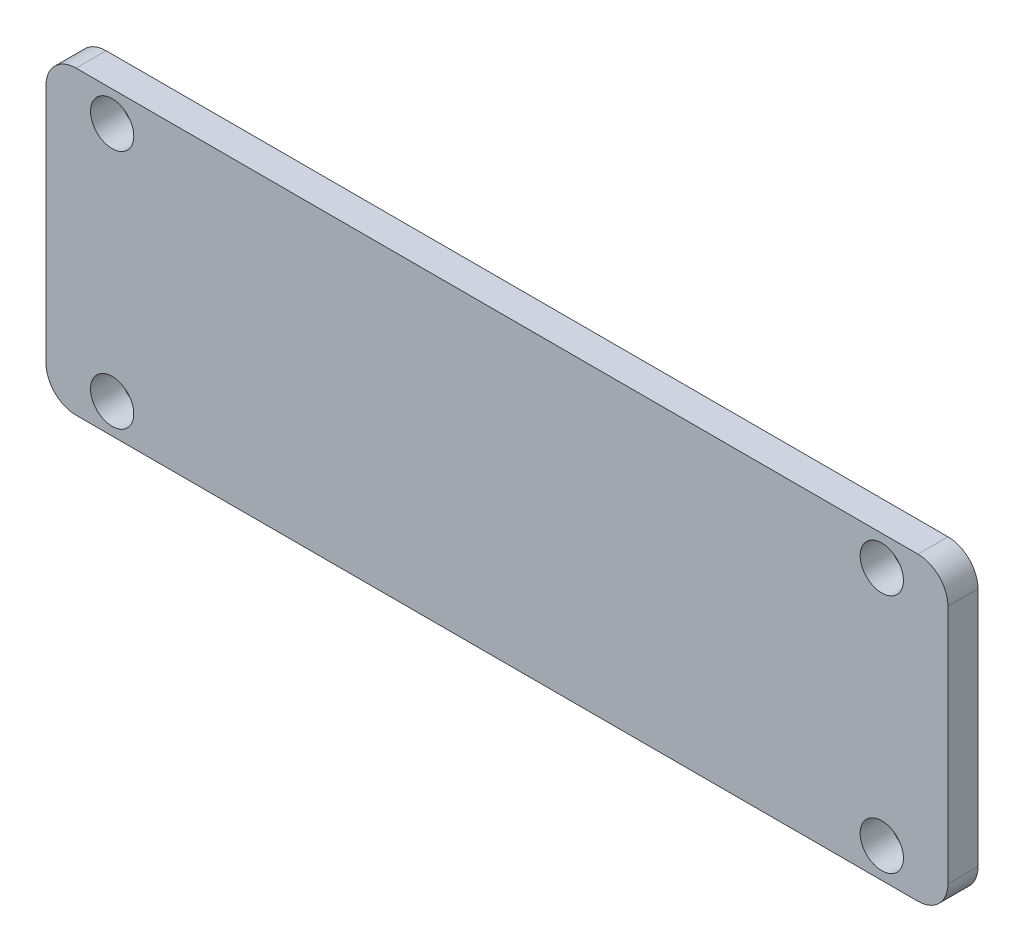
ISO-10303-21;
HEADER;
FILE_DESCRIPTION(('STEP AP214'),'2;1');
FILE_NAME('part.step','',(''),(''),'','','');
FILE_SCHEMA(('AUTOMOTIVE_DESIGN { 1 0 10303 214 1 1 1 1 }'));
ENDSEC;
DATA;
#1=APPLICATION_CONTEXT('core data for automotive mechanical design processes');
#2=APPLICATION_PROTOCOL_DEFINITION('international standard','automotive_design',2000,#1);
#3=PRODUCT_CONTEXT('',#1,'mechanical');
#4=PRODUCT('Part','Part','',(#3));
#5=PRODUCT_RELATED_PRODUCT_CATEGORY('part','',(#4));
#6=PRODUCT_DEFINITION_FORMATION('','',#4);
#7=PRODUCT_DEFINITION_CONTEXT('part definition',#1,'design');
#8=PRODUCT_DEFINITION('design','',#6,#7);
#9=PRODUCT_DEFINITION_SHAPE('','',#8);
#10=(LENGTH_UNIT() NAMED_UNIT(*) SI_UNIT(.MILLI.,.METRE.));
#11=(NAMED_UNIT(*) PLANE_ANGLE_UNIT() SI_UNIT($,.RADIAN.));
#12=(NAMED_UNIT(*) SI_UNIT($,.STERADIAN.) SOLID_ANGLE_UNIT());
#13=UNCERTAINTY_MEASURE_WITH_UNIT(LENGTH_MEASURE(1.E-05),#10,'distance_accuracy_value','');
#14=(GEOMETRIC_REPRESENTATION_CONTEXT(3) GLOBAL_UNCERTAINTY_ASSIGNED_CONTEXT((#13)) GLOBAL_UNIT_ASSIGNED_CONTEXT((#10,
#11,#12)) REPRESENTATION_CONTEXT('',''));
#15=CARTESIAN_POINT('',(0.,0.,0.));
#16=DIRECTION('',(0.,0.,1.));
#17=DIRECTION('',(1.,0.,0.));
#18=AXIS2_PLACEMENT_3D('',#15,#16,#17);
#19=CARTESIAN_POINT('',(-47.625,-15.875,0.));
#20=DIRECTION('',(0.,0.,1.));
#21=DIRECTION('',(1.,0.,0.));
#22=AXIS2_PLACEMENT_3D('',#19,#20,#21);
#23=PLANE('',#22);
#24=CARTESIAN_POINT('',(40.64,12.7,0.));
#25=DIRECTION('',(0.,0.,1.));
#26=DIRECTION('',(-1.,0.,0.));
#27=AXIS2_PLACEMENT_3D('',#24,#25,#26);
#28=CIRCLE('',#27,2.28599999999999);
#29=CARTESIAN_POINT('',(38.354,12.7,0.));
#30=VERTEX_POINT('',#29);
#31=EDGE_CURVE('E172',#30,#30,#28,.T.);
#32=ORIENTED_EDGE('',*,*,#31,.T.);
#33=EDGE_LOOP('',(#32));
#34=FACE_BOUND('',#33,.T.);
#35=CARTESIAN_POINT('',(-40.64,-12.7,0.));
#36=DIRECTION('',(0.,0.,1.));
#37=DIRECTION('',(-1.,0.,0.));
#38=AXIS2_PLACEMENT_3D('',#35,#36,#37);
#39=CIRCLE('',#38,2.28599999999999);
#40=CARTESIAN_POINT('',(-42.926,-12.7,0.));
#41=VERTEX_POINT('',#40);
#42=EDGE_CURVE('E188',#41,#41,#39,.T.);
#43=ORIENTED_EDGE('',*,*,#42,.T.);
#44=EDGE_LOOP('',(#43));
#45=FACE_BOUND('',#44,.T.);
#46=DIRECTION('',(0.,-1.,0.));
#47=VECTOR('',#46,1.);
#48=CARTESIAN_POINT('',(-47.625,15.875,0.));
#49=LINE('',#48,#47);
#50=CARTESIAN_POINT('',(-47.625,12.7,0.));
#51=VERTEX_POINT('',#50);
#52=CARTESIAN_POINT('',(-47.625,-12.7,0.));
#53=VERTEX_POINT('',#52);
#54=EDGE_CURVE('E200',#51,#53,#49,.T.);
#55=ORIENTED_EDGE('',*,*,#54,.F.);
#56=CARTESIAN_POINT('',(-44.45,12.7,0.));
#57=DIRECTION('',(0.,0.,1.));
#58=DIRECTION('',(1.,0.,0.));
#59=AXIS2_PLACEMENT_3D('',#56,#57,#58);
#60=CIRCLE('',#59,3.175);
#61=CARTESIAN_POINT('',(-44.45,15.875,0.));
#62=VERTEX_POINT('',#61);
#63=EDGE_CURVE('E234',#51,#62,#60,.F.);
#64=ORIENTED_EDGE('',*,*,#63,.T.);
#65=DIRECTION('',(-1.,0.,0.));
#66=VECTOR('',#65,1.);
#67=CARTESIAN_POINT('',(-47.625,15.875,0.));
#68=LINE('',#67,#66);
#69=CARTESIAN_POINT('',(44.45,15.875,0.));
#70=VERTEX_POINT('',#69);
#71=EDGE_CURVE('E207',#70,#62,#68,.T.);
#72=ORIENTED_EDGE('',*,*,#71,.F.);
#73=CARTESIAN_POINT('',(44.45,12.7,0.));
#74=DIRECTION('',(0.,0.,1.));
#75=DIRECTION('',(1.,0.,0.));
#76=AXIS2_PLACEMENT_3D('',#73,#74,#75);
#77=CIRCLE('',#76,3.175);
#78=CARTESIAN_POINT('',(47.625,12.7,0.));
#79=VERTEX_POINT('',#78);
#80=EDGE_CURVE('E228',#70,#79,#77,.F.);
#81=ORIENTED_EDGE('',*,*,#80,.T.);
#82=DIRECTION('',(0.,1.,0.));
#83=VECTOR('',#82,1.);
#84=CARTESIAN_POINT('',(47.625,15.875,0.));
#85=LINE('',#84,#83);
#86=CARTESIAN_POINT('',(47.625,-12.7,0.));
#87=VERTEX_POINT('',#86);
#88=EDGE_CURVE('E220',#87,#79,#85,.T.);
#89=ORIENTED_EDGE('',*,*,#88,.F.);
#90=CARTESIAN_POINT('',(44.45,-12.7,0.));
#91=DIRECTION('',(0.,0.,1.));
#92=DIRECTION('',(1.,0.,0.));
#93=AXIS2_PLACEMENT_3D('',#90,#91,#92);
#94=CIRCLE('',#93,3.175);
#95=CARTESIAN_POINT('',(44.45,-15.875,0.));
#96=VERTEX_POINT('',#95);
#97=EDGE_CURVE('E230',#87,#96,#94,.F.);
#98=ORIENTED_EDGE('',*,*,#97,.T.);
#99=DIRECTION('',(1.,0.,0.));
#100=VECTOR('',#99,1.);
#101=CARTESIAN_POINT('',(-47.625,-15.875,0.));
#102=LINE('',#101,#100);
#103=CARTESIAN_POINT('',(-44.45,-15.875,0.));
#104=VERTEX_POINT('',#103);
#105=EDGE_CURVE('E217',#104,#96,#102,.T.);
#106=ORIENTED_EDGE('',*,*,#105,.F.);
#107=CARTESIAN_POINT('',(-44.45,-12.7,0.));
#108=DIRECTION('',(0.,0.,1.));
#109=DIRECTION('',(1.,0.,0.));
#110=AXIS2_PLACEMENT_3D('',#107,#108,#109);
#111=CIRCLE('',#110,3.175);
#112=EDGE_CURVE('E232',#104,#53,#111,.F.);
#113=ORIENTED_EDGE('',*,*,#112,.T.);
#114=EDGE_LOOP('',(#55,#64,#72,#81,#89,#98,#106,#113));
#115=FACE_BOUND('',#114,.T.);
#116=CARTESIAN_POINT('',(-40.64,12.7,0.));
#117=DIRECTION('',(0.,0.,1.));
#118=DIRECTION('',(1.,0.,0.));
#119=AXIS2_PLACEMENT_3D('',#116,#117,#118);
#120=CIRCLE('',#119,2.28599999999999);
#121=CARTESIAN_POINT('',(-38.354,12.7,0.));
#122=VERTEX_POINT('',#121);
#123=EDGE_CURVE('E194',#122,#122,#120,.T.);
#124=ORIENTED_EDGE('',*,*,#123,.T.);
#125=EDGE_LOOP('',(#124));
#126=FACE_BOUND('',#125,.T.);
#127=CARTESIAN_POINT('',(40.64,-12.7,0.));
#128=DIRECTION('',(0.,0.,1.));
#129=DIRECTION('',(1.,0.,0.));
#130=AXIS2_PLACEMENT_3D('',#127,#128,#129);
#131=CIRCLE('',#130,2.28599999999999);
#132=CARTESIAN_POINT('',(42.926,-12.7,0.));
#133=VERTEX_POINT('',#132);
#134=EDGE_CURVE('E183',#133,#133,#131,.T.);
#135=ORIENTED_EDGE('',*,*,#134,.T.);
#136=EDGE_LOOP('',(#135));
#137=FACE_BOUND('',#136,.T.);
#138=CARTESIAN_POINT('',(-15.875,3.17499999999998,0.));
#139=DIRECTION('',(0.,0.,1.));
#140=DIRECTION('',(1.,0.,0.));
#141=AXIS2_PLACEMENT_3D('',#138,#139,#140);
#142=CIRCLE('',#141,3.175);
#143=CARTESIAN_POINT('',(-15.875,6.34999999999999,0.));
#144=VERTEX_POINT('',#143);
#145=CARTESIAN_POINT('',(-19.05,3.17499999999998,0.));
#146=VERTEX_POINT('',#145);
#147=EDGE_CURVE('E530',#144,#146,#142,.T.);
#148=ORIENTED_EDGE('',*,*,#147,.T.);
#149=DIRECTION('',(0.,-1.,0.));
#150=VECTOR('',#149,1.);
#151=CARTESIAN_POINT('',(-19.05,3.17499999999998,0.));
#152=LINE('',#151,#150);
#153=CARTESIAN_POINT('',(-19.05,-3.175,0.));
#154=VERTEX_POINT('',#153);
#155=EDGE_CURVE('E171',#146,#154,#152,.T.);
#156=ORIENTED_EDGE('',*,*,#155,.T.);
#157=CARTESIAN_POINT('',(-15.875,-3.175,0.));
#158=DIRECTION('',(0.,0.,1.));
#159=DIRECTION('',(1.,0.,0.));
#160=AXIS2_PLACEMENT_3D('',#157,#158,#159);
#161=CIRCLE('',#160,3.175);
#162=CARTESIAN_POINT('',(-15.875,-6.35,0.));
#163=VERTEX_POINT('',#162);
#164=EDGE_CURVE('E523',#154,#163,#161,.T.);
#165=ORIENTED_EDGE('',*,*,#164,.T.);
#166=DIRECTION('',(1.,0.,0.));
#167=VECTOR('',#166,1.);
#168=CARTESIAN_POINT('',(-15.875,-6.35,0.));
#169=LINE('',#168,#167);
#170=CARTESIAN_POINT('',(15.875,-6.35,0.));
#171=VERTEX_POINT('',#170);
#172=EDGE_CURVE('E525',#163,#171,#169,.T.);
#173=ORIENTED_EDGE('',*,*,#172,.T.);
#174=CARTESIAN_POINT('',(15.875,-3.175,0.));
#175=DIRECTION('',(0.,0.,1.));
#176=DIRECTION('',(-1.,0.,0.));
#177=AXIS2_PLACEMENT_3D('',#174,#175,#176);
#178=CIRCLE('',#177,3.175);
#179=CARTESIAN_POINT('',(19.05,-3.175,0.));
#180=VERTEX_POINT('',#179);
#181=EDGE_CURVE('E507',#171,#180,#178,.T.);
#182=ORIENTED_EDGE('',*,*,#181,.T.);
#183=DIRECTION('',(0.,1.,0.));
#184=VECTOR('',#183,1.);
#185=CARTESIAN_POINT('',(19.05,3.17499999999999,0.));
#186=LINE('',#185,#184);
#187=CARTESIAN_POINT('',(19.05,3.17499999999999,0.));
#188=VERTEX_POINT('',#187);
#189=EDGE_CURVE('E504',#180,#188,#186,.T.);
#190=ORIENTED_EDGE('',*,*,#189,.T.);
#191=CARTESIAN_POINT('',(15.875,3.17499999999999,0.));
#192=DIRECTION('',(0.,0.,1.));
#193=DIRECTION('',(-1.,0.,0.));
#194=AXIS2_PLACEMENT_3D('',#191,#192,#193);
#195=CIRCLE('',#194,3.175);
#196=CARTESIAN_POINT('',(15.875,6.34999999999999,0.));
#197=VERTEX_POINT('',#196);
#198=EDGE_CURVE('E498',#188,#197,#195,.T.);
#199=ORIENTED_EDGE('',*,*,#198,.T.);
#200=DIRECTION('',(-1.,0.,0.));
#201=VECTOR('',#200,1.);
#202=CARTESIAN_POINT('',(-15.875,6.34999999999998,0.));
#203=LINE('',#202,#201);
#204=EDGE_CURVE('E167',#197,#144,#203,.T.);
#205=ORIENTED_EDGE('',*,*,#204,.T.);
#206=EDGE_LOOP('',(#148,#156,#165,#173,#182,#190,#199,#205));
#207=FACE_BOUND('',#206,.T.);
#208=ADVANCED_FACE('F34',(#34,#45,#115,#126,#137,#207),#23,.F.);
#209=CARTESIAN_POINT('',(-47.625,-15.875,3.175));
#210=DIRECTION('',(0.,0.,1.));
#211=DIRECTION('',(1.,0.,0.));
#212=AXIS2_PLACEMENT_3D('',#209,#210,#211);
#213=PLANE('',#212);
#214=CARTESIAN_POINT('',(40.64,-12.7,3.175));
#215=DIRECTION('',(0.,0.,1.));
#216=DIRECTION('',(1.,0.,0.));
#217=AXIS2_PLACEMENT_3D('',#214,#215,#216);
#218=CIRCLE('',#217,2.28599999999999);
#219=CARTESIAN_POINT('',(42.926,-12.7,3.175));
#220=VERTEX_POINT('',#219);
#221=EDGE_CURVE('E185',#220,#220,#218,.T.);
#222=ORIENTED_EDGE('',*,*,#221,.F.);
#223=EDGE_LOOP('',(#222));
#224=FACE_BOUND('',#223,.T.);
#225=CARTESIAN_POINT('',(-40.64,12.7,3.175));
#226=DIRECTION('',(0.,0.,1.));
#227=DIRECTION('',(1.,0.,0.));
#228=AXIS2_PLACEMENT_3D('',#225,#226,#227);
#229=CIRCLE('',#228,2.28599999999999);
#230=CARTESIAN_POINT('',(-38.354,12.7,3.175));
#231=VERTEX_POINT('',#230);
#232=EDGE_CURVE('E197',#231,#231,#229,.T.);
#233=ORIENTED_EDGE('',*,*,#232,.F.);
#234=EDGE_LOOP('',(#233));
#235=FACE_BOUND('',#234,.T.);
#236=DIRECTION('',(-1.,0.,0.));
#237=VECTOR('',#236,1.);
#238=CARTESIAN_POINT('',(-47.625,15.875,3.175));
#239=LINE('',#238,#237);
#240=CARTESIAN_POINT('',(44.45,15.875,3.175));
#241=VERTEX_POINT('',#240);
#242=CARTESIAN_POINT('',(-44.45,15.875,3.175));
#243=VERTEX_POINT('',#242);
#244=EDGE_CURVE('E211',#241,#243,#239,.T.);
#245=ORIENTED_EDGE('',*,*,#244,.T.);
#246=CARTESIAN_POINT('',(-44.45,12.7,3.175));
#247=DIRECTION('',(0.,0.,1.));
#248=DIRECTION('',(1.,0.,0.));
#249=AXIS2_PLACEMENT_3D('',#246,#247,#248);
#250=CIRCLE('',#249,3.175);
#251=CARTESIAN_POINT('',(-47.625,12.7,3.175));
#252=VERTEX_POINT('',#251);
#253=EDGE_CURVE('E246',#243,#252,#250,.T.);
#254=ORIENTED_EDGE('',*,*,#253,.T.);
#255=DIRECTION('',(0.,-1.,0.));
#256=VECTOR('',#255,1.);
#257=CARTESIAN_POINT('',(-47.625,15.875,3.175));
#258=LINE('',#257,#256);
#259=CARTESIAN_POINT('',(-47.625,-12.7,3.175));
#260=VERTEX_POINT('',#259);
#261=EDGE_CURVE('E203',#252,#260,#258,.T.);
#262=ORIENTED_EDGE('',*,*,#261,.T.);
#263=CARTESIAN_POINT('',(-44.45,-12.7,3.175));
#264=DIRECTION('',(0.,0.,1.));
#265=DIRECTION('',(1.,0.,0.));
#266=AXIS2_PLACEMENT_3D('',#263,#264,#265);
#267=CIRCLE('',#266,3.175);
#268=CARTESIAN_POINT('',(-44.45,-15.875,3.175));
#269=VERTEX_POINT('',#268);
#270=EDGE_CURVE('E244',#260,#269,#267,.T.);
#271=ORIENTED_EDGE('',*,*,#270,.T.);
#272=DIRECTION('',(1.,0.,0.));
#273=VECTOR('',#272,1.);
#274=CARTESIAN_POINT('',(-47.625,-15.875,3.175));
#275=LINE('',#274,#273);
#276=CARTESIAN_POINT('',(44.45,-15.875,3.175));
#277=VERTEX_POINT('',#276);
#278=EDGE_CURVE('E206',#269,#277,#275,.T.);
#279=ORIENTED_EDGE('',*,*,#278,.T.);
#280=CARTESIAN_POINT('',(44.45,-12.7,3.175));
#281=DIRECTION('',(0.,0.,1.));
#282=DIRECTION('',(1.,0.,0.));
#283=AXIS2_PLACEMENT_3D('',#280,#281,#282);
#284=CIRCLE('',#283,3.175);
#285=CARTESIAN_POINT('',(47.625,-12.7,3.175));
#286=VERTEX_POINT('',#285);
#287=EDGE_CURVE('E55',#277,#286,#284,.T.);
#288=ORIENTED_EDGE('',*,*,#287,.T.);
#289=DIRECTION('',(0.,1.,0.));
#290=VECTOR('',#289,1.);
#291=CARTESIAN_POINT('',(47.625,15.875,3.175));
#292=LINE('',#291,#290);
#293=CARTESIAN_POINT('',(47.625,12.7,3.175));
#294=VERTEX_POINT('',#293);
#295=EDGE_CURVE('E209',#286,#294,#292,.T.);
#296=ORIENTED_EDGE('',*,*,#295,.T.);
#297=CARTESIAN_POINT('',(44.45,12.7,3.175));
#298=DIRECTION('',(0.,0.,1.));
#299=DIRECTION('',(1.,0.,0.));
#300=AXIS2_PLACEMENT_3D('',#297,#298,#299);
#301=CIRCLE('',#300,3.175);
#302=EDGE_CURVE('E241',#294,#241,#301,.T.);
#303=ORIENTED_EDGE('',*,*,#302,.T.);
#304=EDGE_LOOP('',(#245,#254,#262,#271,#279,#288,#296,#303));
#305=FACE_BOUND('',#304,.T.);
#306=CARTESIAN_POINT('',(-40.64,-12.7,3.175));
#307=DIRECTION('',(0.,0.,1.));
#308=DIRECTION('',(-1.,0.,0.));
#309=AXIS2_PLACEMENT_3D('',#306,#307,#308);
#310=CIRCLE('',#309,2.28599999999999);
#311=CARTESIAN_POINT('',(-42.926,-12.7,3.175));
#312=VERTEX_POINT('',#311);
#313=EDGE_CURVE('E191',#312,#312,#310,.T.);
#314=ORIENTED_EDGE('',*,*,#313,.F.);
#315=EDGE_LOOP('',(#314));
#316=FACE_BOUND('',#315,.T.);
#317=CARTESIAN_POINT('',(40.64,12.7,3.175));
#318=DIRECTION('',(0.,0.,1.));
#319=DIRECTION('',(-1.,0.,0.));
#320=AXIS2_PLACEMENT_3D('',#317,#318,#319);
#321=CIRCLE('',#320,2.28599999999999);
#322=CARTESIAN_POINT('',(38.354,12.7,3.175));
#323=VERTEX_POINT('',#322);
#324=EDGE_CURVE('E176',#323,#323,#321,.T.);
#325=ORIENTED_EDGE('',*,*,#324,.F.);
#326=EDGE_LOOP('',(#325));
#327=FACE_BOUND('',#326,.T.);
#328=ADVANCED_FACE('F269',(#224,#235,#305,#316,#327),#213,.T.);
#329=CARTESIAN_POINT('',(-47.625,15.875,3.175));
#330=DIRECTION('',(1.,0.,0.));
#331=DIRECTION('',(0.,0.,-1.));
#332=AXIS2_PLACEMENT_3D('',#329,#330,#331);
#333=PLANE('',#332);
#334=ORIENTED_EDGE('',*,*,#261,.F.);
#335=DIRECTION('',(0.,0.,-1.));
#336=VECTOR('',#335,1.);
#337=CARTESIAN_POINT('',(-47.625,12.7,3.175));
#338=LINE('',#337,#336);
#339=EDGE_CURVE('E225',#252,#51,#338,.T.);
#340=ORIENTED_EDGE('',*,*,#339,.T.);
#341=ORIENTED_EDGE('',*,*,#54,.T.);
#342=DIRECTION('',(0.,0.,-1.));
#343=VECTOR('',#342,1.);
#344=CARTESIAN_POINT('',(-47.625,-12.7,3.175));
#345=LINE('',#344,#343);
#346=EDGE_CURVE('E214',#53,#260,#345,.F.);
#347=ORIENTED_EDGE('',*,*,#346,.T.);
#348=EDGE_LOOP('',(#334,#340,#341,#347));
#349=FACE_BOUND('',#348,.T.);
#350=ADVANCED_FACE('F284',(#349),#333,.F.);
#351=CARTESIAN_POINT('',(-47.625,-15.875,3.175));
#352=DIRECTION('',(0.,1.,0.));
#353=DIRECTION('',(0.,0.,1.));
#354=AXIS2_PLACEMENT_3D('',#351,#352,#353);
#355=PLANE('',#354);
#356=ORIENTED_EDGE('',*,*,#278,.F.);
#357=DIRECTION('',(0.,0.,-1.));
#358=VECTOR('',#357,1.);
#359=CARTESIAN_POINT('',(-44.45,-15.875,3.175));
#360=LINE('',#359,#358);
#361=EDGE_CURVE('E250',#269,#104,#360,.T.);
#362=ORIENTED_EDGE('',*,*,#361,.T.);
#363=ORIENTED_EDGE('',*,*,#105,.T.);
#364=DIRECTION('',(0.,0.,-1.));
#365=VECTOR('',#364,1.);
#366=CARTESIAN_POINT('',(44.45,-15.875,3.175));
#367=LINE('',#366,#365);
#368=EDGE_CURVE('E248',#96,#277,#367,.F.);
#369=ORIENTED_EDGE('',*,*,#368,.T.);
#370=EDGE_LOOP('',(#356,#362,#363,#369));
#371=FACE_BOUND('',#370,.T.);
#372=ADVANCED_FACE('F256',(#371),#355,.F.);
#373=CARTESIAN_POINT('',(47.625,15.875,3.175));
#374=DIRECTION('',(-1.,0.,0.));
#375=DIRECTION('',(0.,0.,1.));
#376=AXIS2_PLACEMENT_3D('',#373,#374,#375);
#377=PLANE('',#376);
#378=ORIENTED_EDGE('',*,*,#295,.F.);
#379=DIRECTION('',(0.,0.,-1.));
#380=VECTOR('',#379,1.);
#381=CARTESIAN_POINT('',(47.625,-12.7,3.175));
#382=LINE('',#381,#380);
#383=EDGE_CURVE('E11',#286,#87,#382,.T.);
#384=ORIENTED_EDGE('',*,*,#383,.T.);
#385=ORIENTED_EDGE('',*,*,#88,.T.);
#386=DIRECTION('',(0.,0.,-1.));
#387=VECTOR('',#386,1.);
#388=CARTESIAN_POINT('',(47.625,12.7,3.175));
#389=LINE('',#388,#387);
#390=EDGE_CURVE('E42',#79,#294,#389,.F.);
#391=ORIENTED_EDGE('',*,*,#390,.T.);
#392=EDGE_LOOP('',(#378,#384,#385,#391));
#393=FACE_BOUND('',#392,.T.);
#394=ADVANCED_FACE('F267',(#393),#377,.F.);
#395=CARTESIAN_POINT('',(-47.625,15.875,3.175));
#396=DIRECTION('',(0.,-1.,0.));
#397=DIRECTION('',(0.,0.,-1.));
#398=AXIS2_PLACEMENT_3D('',#395,#396,#397);
#399=PLANE('',#398);
#400=ORIENTED_EDGE('',*,*,#71,.T.);
#401=DIRECTION('',(0.,0.,-1.));
#402=VECTOR('',#401,1.);
#403=CARTESIAN_POINT('',(-44.45,15.875,3.175));
#404=LINE('',#403,#402);
#405=EDGE_CURVE('E239',#62,#243,#404,.F.);
#406=ORIENTED_EDGE('',*,*,#405,.T.);
#407=ORIENTED_EDGE('',*,*,#244,.F.);
#408=DIRECTION('',(0.,0.,-1.));
#409=VECTOR('',#408,1.);
#410=CARTESIAN_POINT('',(44.45,15.875,3.175));
#411=LINE('',#410,#409);
#412=EDGE_CURVE('E236',#241,#70,#411,.T.);
#413=ORIENTED_EDGE('',*,*,#412,.T.);
#414=EDGE_LOOP('',(#400,#406,#407,#413));
#415=FACE_BOUND('',#414,.T.);
#416=ADVANCED_FACE('F276',(#415),#399,.F.);
#417=CARTESIAN_POINT('',(-40.64,12.7,3.175));
#418=DIRECTION('',(0.,0.,-1.));
#419=DIRECTION('',(-1.,0.,0.));
#420=AXIS2_PLACEMENT_3D('',#417,#418,#419);
#421=CYLINDRICAL_SURFACE('',#420,2.28599999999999);
#422=ORIENTED_EDGE('',*,*,#232,.T.);
#423=EDGE_LOOP('',(#422));
#424=FACE_BOUND('',#423,.T.);
#425=ORIENTED_EDGE('',*,*,#123,.F.);
#426=EDGE_LOOP('',(#425));
#427=FACE_BOUND('',#426,.T.);
#428=ADVANCED_FACE('F307',(#424,#427),#421,.F.);
#429=CARTESIAN_POINT('',(-40.64,-12.7,3.175));
#430=DIRECTION('',(0.,0.,-1.));
#431=DIRECTION('',(-1.,0.,0.));
#432=AXIS2_PLACEMENT_3D('',#429,#430,#431);
#433=CYLINDRICAL_SURFACE('',#432,2.28599999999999);
#434=ORIENTED_EDGE('',*,*,#313,.T.);
#435=EDGE_LOOP('',(#434));
#436=FACE_BOUND('',#435,.T.);
#437=ORIENTED_EDGE('',*,*,#42,.F.);
#438=EDGE_LOOP('',(#437));
#439=FACE_BOUND('',#438,.T.);
#440=ADVANCED_FACE('F336',(#436,#439),#433,.F.);
#441=CARTESIAN_POINT('',(40.64,-12.7,3.175));
#442=DIRECTION('',(0.,0.,-1.));
#443=DIRECTION('',(-1.,0.,0.));
#444=AXIS2_PLACEMENT_3D('',#441,#442,#443);
#445=CYLINDRICAL_SURFACE('',#444,2.28599999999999);
#446=ORIENTED_EDGE('',*,*,#221,.T.);
#447=EDGE_LOOP('',(#446));
#448=FACE_BOUND('',#447,.T.);
#449=ORIENTED_EDGE('',*,*,#134,.F.);
#450=EDGE_LOOP('',(#449));
#451=FACE_BOUND('',#450,.T.);
#452=ADVANCED_FACE('F343',(#448,#451),#445,.F.);
#453=CARTESIAN_POINT('',(40.64,12.7,3.175));
#454=DIRECTION('',(0.,0.,-1.));
#455=DIRECTION('',(-1.,0.,0.));
#456=AXIS2_PLACEMENT_3D('',#453,#454,#455);
#457=CYLINDRICAL_SURFACE('',#456,2.28599999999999);
#458=ORIENTED_EDGE('',*,*,#324,.T.);
#459=EDGE_LOOP('',(#458));
#460=FACE_BOUND('',#459,.T.);
#461=ORIENTED_EDGE('',*,*,#31,.F.);
#462=EDGE_LOOP('',(#461));
#463=FACE_BOUND('',#462,.T.);
#464=ADVANCED_FACE('F351',(#460,#463),#457,.F.);
#465=CARTESIAN_POINT('',(-15.875,3.17499999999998,0.635));
#466=DIRECTION('',(0.,0.,-1.));
#467=DIRECTION('',(-1.,0.,0.));
#468=AXIS2_PLACEMENT_3D('',#465,#466,#467);
#469=CYLINDRICAL_SURFACE('',#468,3.175);
#470=ORIENTED_EDGE('',*,*,#147,.F.);
#471=DIRECTION('',(0.,0.,-1.));
#472=VECTOR('',#471,1.);
#473=CARTESIAN_POINT('',(-15.875,6.34999999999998,0.635));
#474=LINE('',#473,#472);
#475=CARTESIAN_POINT('',(-15.875,6.34999999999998,0.635));
#476=VERTEX_POINT('',#475);
#477=EDGE_CURVE('E166',#476,#144,#474,.T.);
#478=ORIENTED_EDGE('',*,*,#477,.F.);
#479=CARTESIAN_POINT('',(-15.875,3.17499999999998,0.635));
#480=DIRECTION('',(0.,0.,1.));
#481=DIRECTION('',(1.,0.,0.));
#482=AXIS2_PLACEMENT_3D('',#479,#480,#481);
#483=CIRCLE('',#482,3.175);
#484=CARTESIAN_POINT('',(-19.05,3.17499999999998,0.635));
#485=VERTEX_POINT('',#484);
#486=EDGE_CURVE('E152',#476,#485,#483,.T.);
#487=ORIENTED_EDGE('',*,*,#486,.T.);
#488=DIRECTION('',(0.,0.,-1.));
#489=VECTOR('',#488,1.);
#490=CARTESIAN_POINT('',(-19.05,3.17499999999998,0.635));
#491=LINE('',#490,#489);
#492=EDGE_CURVE('E163',#485,#146,#491,.T.);
#493=ORIENTED_EDGE('',*,*,#492,.T.);
#494=EDGE_LOOP('',(#470,#478,#487,#493));
#495=FACE_BOUND('',#494,.T.);
#496=ADVANCED_FACE('F162',(#495),#469,.F.);
#497=CARTESIAN_POINT('',(-19.05,3.17499999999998,0.635));
#498=DIRECTION('',(1.,0.,0.));
#499=DIRECTION('',(0.,0.,-1.));
#500=AXIS2_PLACEMENT_3D('',#497,#498,#499);
#501=PLANE('',#500);
#502=ORIENTED_EDGE('',*,*,#155,.F.);
#503=ORIENTED_EDGE('',*,*,#492,.F.);
#504=DIRECTION('',(0.,-1.,0.));
#505=VECTOR('',#504,1.);
#506=CARTESIAN_POINT('',(-19.05,3.17499999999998,0.635));
#507=LINE('',#506,#505);
#508=CARTESIAN_POINT('',(-19.05,-3.175,0.635));
#509=VERTEX_POINT('',#508);
#510=EDGE_CURVE('E148',#485,#509,#507,.T.);
#511=ORIENTED_EDGE('',*,*,#510,.T.);
#512=DIRECTION('',(0.,0.,-1.));
#513=VECTOR('',#512,1.);
#514=CARTESIAN_POINT('',(-19.05,-3.175,0.635));
#515=LINE('',#514,#513);
#516=EDGE_CURVE('E173',#509,#154,#515,.T.);
#517=ORIENTED_EDGE('',*,*,#516,.T.);
#518=EDGE_LOOP('',(#502,#503,#511,#517));
#519=FACE_BOUND('',#518,.T.);
#520=ADVANCED_FACE('F169',(#519),#501,.T.);
#521=CARTESIAN_POINT('',(-15.875,-3.175,0.635));
#522=DIRECTION('',(0.,0.,-1.));
#523=DIRECTION('',(-1.,0.,0.));
#524=AXIS2_PLACEMENT_3D('',#521,#522,#523);
#525=CYLINDRICAL_SURFACE('',#524,3.175);
#526=ORIENTED_EDGE('',*,*,#164,.F.);
#527=ORIENTED_EDGE('',*,*,#516,.F.);
#528=CARTESIAN_POINT('',(-15.875,-3.175,0.635));
#529=DIRECTION('',(0.,0.,1.));
#530=DIRECTION('',(1.,0.,0.));
#531=AXIS2_PLACEMENT_3D('',#528,#529,#530);
#532=CIRCLE('',#531,3.175);
#533=CARTESIAN_POINT('',(-15.875,-6.35,0.635));
#534=VERTEX_POINT('',#533);
#535=EDGE_CURVE('E154',#509,#534,#532,.T.);
#536=ORIENTED_EDGE('',*,*,#535,.T.);
#537=DIRECTION('',(0.,0.,-1.));
#538=VECTOR('',#537,1.);
#539=CARTESIAN_POINT('',(-15.875,-6.35,0.635));
#540=LINE('',#539,#538);
#541=EDGE_CURVE('E178',#534,#163,#540,.T.);
#542=ORIENTED_EDGE('',*,*,#541,.T.);
#543=EDGE_LOOP('',(#526,#527,#536,#542));
#544=FACE_BOUND('',#543,.T.);
#545=ADVANCED_FACE('F372',(#544),#525,.F.);
#546=CARTESIAN_POINT('',(-15.875,-6.35,0.635));
#547=DIRECTION('',(0.,1.,0.));
#548=DIRECTION('',(-1.,0.,0.));
#549=AXIS2_PLACEMENT_3D('',#546,#547,#548);
#550=PLANE('',#549);
#551=ORIENTED_EDGE('',*,*,#172,.F.);
#552=ORIENTED_EDGE('',*,*,#541,.F.);
#553=DIRECTION('',(1.,0.,0.));
#554=VECTOR('',#553,1.);
#555=CARTESIAN_POINT('',(-15.875,-6.35,0.635));
#556=LINE('',#555,#554);
#557=CARTESIAN_POINT('',(15.875,-6.35,0.635));
#558=VERTEX_POINT('',#557);
#559=EDGE_CURVE('E545',#534,#558,#556,.T.);
#560=ORIENTED_EDGE('',*,*,#559,.T.);
#561=DIRECTION('',(0.,0.,-1.));
#562=VECTOR('',#561,1.);
#563=CARTESIAN_POINT('',(15.875,-6.35,0.635));
#564=LINE('',#563,#562);
#565=EDGE_CURVE('E518',#558,#171,#564,.T.);
#566=ORIENTED_EDGE('',*,*,#565,.T.);
#567=EDGE_LOOP('',(#551,#552,#560,#566));
#568=FACE_BOUND('',#567,.T.);
#569=ADVANCED_FACE('F379',(#568),#550,.T.);
#570=CARTESIAN_POINT('',(15.875,-3.175,0.635));
#571=DIRECTION('',(0.,0.,-1.));
#572=DIRECTION('',(-1.,0.,0.));
#573=AXIS2_PLACEMENT_3D('',#570,#571,#572);
#574=CYLINDRICAL_SURFACE('',#573,3.175);
#575=ORIENTED_EDGE('',*,*,#181,.F.);
#576=ORIENTED_EDGE('',*,*,#565,.F.);
#577=CARTESIAN_POINT('',(15.875,-3.175,0.635));
#578=DIRECTION('',(0.,0.,1.));
#579=DIRECTION('',(-1.,0.,0.));
#580=AXIS2_PLACEMENT_3D('',#577,#578,#579);
#581=CIRCLE('',#580,3.175);
#582=CARTESIAN_POINT('',(19.05,-3.175,0.635));
#583=VERTEX_POINT('',#582);
#584=EDGE_CURVE('E535',#558,#583,#581,.T.);
#585=ORIENTED_EDGE('',*,*,#584,.T.);
#586=DIRECTION('',(0.,0.,-1.));
#587=VECTOR('',#586,1.);
#588=CARTESIAN_POINT('',(19.05,-3.175,0.635));
#589=LINE('',#588,#587);
#590=EDGE_CURVE('E516',#583,#180,#589,.T.);
#591=ORIENTED_EDGE('',*,*,#590,.T.);
#592=EDGE_LOOP('',(#575,#576,#585,#591));
#593=FACE_BOUND('',#592,.T.);
#594=ADVANCED_FACE('F387',(#593),#574,.F.);
#595=CARTESIAN_POINT('',(19.05,3.17499999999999,0.635));
#596=DIRECTION('',(-1.,0.,0.));
#597=DIRECTION('',(0.,0.,1.));
#598=AXIS2_PLACEMENT_3D('',#595,#596,#597);
#599=PLANE('',#598);
#600=ORIENTED_EDGE('',*,*,#189,.F.);
#601=ORIENTED_EDGE('',*,*,#590,.F.);
#602=DIRECTION('',(0.,1.,0.));
#603=VECTOR('',#602,1.);
#604=CARTESIAN_POINT('',(19.05,3.17499999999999,0.635));
#605=LINE('',#604,#603);
#606=CARTESIAN_POINT('',(19.05,3.17499999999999,0.635));
#607=VERTEX_POINT('',#606);
#608=EDGE_CURVE('E537',#583,#607,#605,.T.);
#609=ORIENTED_EDGE('',*,*,#608,.T.);
#610=DIRECTION('',(0.,0.,-1.));
#611=VECTOR('',#610,1.);
#612=CARTESIAN_POINT('',(19.05,3.17499999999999,0.635));
#613=LINE('',#612,#611);
#614=EDGE_CURVE('E514',#607,#188,#613,.T.);
#615=ORIENTED_EDGE('',*,*,#614,.T.);
#616=EDGE_LOOP('',(#600,#601,#609,#615));
#617=FACE_BOUND('',#616,.T.);
#618=ADVANCED_FACE('F395',(#617),#599,.T.);
#619=CARTESIAN_POINT('',(15.875,3.17499999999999,0.635));
#620=DIRECTION('',(0.,0.,-1.));
#621=DIRECTION('',(-1.,0.,0.));
#622=AXIS2_PLACEMENT_3D('',#619,#620,#621);
#623=CYLINDRICAL_SURFACE('',#622,3.175);
#624=ORIENTED_EDGE('',*,*,#198,.F.);
#625=ORIENTED_EDGE('',*,*,#614,.F.);
#626=CARTESIAN_POINT('',(15.875,3.17499999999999,0.635));
#627=DIRECTION('',(0.,0.,1.));
#628=DIRECTION('',(-1.,0.,0.));
#629=AXIS2_PLACEMENT_3D('',#626,#627,#628);
#630=CIRCLE('',#629,3.175);
#631=CARTESIAN_POINT('',(15.875,6.34999999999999,0.635));
#632=VERTEX_POINT('',#631);
#633=EDGE_CURVE('E539',#607,#632,#630,.T.);
#634=ORIENTED_EDGE('',*,*,#633,.T.);
#635=DIRECTION('',(0.,0.,-1.));
#636=VECTOR('',#635,1.);
#637=CARTESIAN_POINT('',(15.875,6.34999999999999,0.635));
#638=LINE('',#637,#636);
#639=EDGE_CURVE('E496',#632,#197,#638,.T.);
#640=ORIENTED_EDGE('',*,*,#639,.T.);
#641=EDGE_LOOP('',(#624,#625,#634,#640));
#642=FACE_BOUND('',#641,.T.);
#643=ADVANCED_FACE('F403',(#642),#623,.F.);
#644=CARTESIAN_POINT('',(-15.875,6.34999999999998,0.635));
#645=DIRECTION('',(0.,-1.,0.));
#646=DIRECTION('',(1.,0.,0.));
#647=AXIS2_PLACEMENT_3D('',#644,#645,#646);
#648=PLANE('',#647);
#649=ORIENTED_EDGE('',*,*,#204,.F.);
#650=ORIENTED_EDGE('',*,*,#639,.F.);
#651=DIRECTION('',(-1.,0.,0.));
#652=VECTOR('',#651,1.);
#653=CARTESIAN_POINT('',(-15.875,6.34999999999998,0.635));
#654=LINE('',#653,#652);
#655=EDGE_CURVE('E512',#632,#476,#654,.T.);
#656=ORIENTED_EDGE('',*,*,#655,.T.);
#657=ORIENTED_EDGE('',*,*,#477,.T.);
#658=EDGE_LOOP('',(#649,#650,#656,#657));
#659=FACE_BOUND('',#658,.T.);
#660=ADVANCED_FACE('F411',(#659),#648,.T.);
#661=CARTESIAN_POINT('',(-15.875,3.17499999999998,0.635));
#662=DIRECTION('',(0.,0.,1.));
#663=DIRECTION('',(1.,0.,0.));
#664=AXIS2_PLACEMENT_3D('',#661,#662,#663);
#665=PLANE('',#664);
#666=ORIENTED_EDGE('',*,*,#486,.F.);
#667=ORIENTED_EDGE('',*,*,#655,.F.);
#668=ORIENTED_EDGE('',*,*,#633,.F.);
#669=ORIENTED_EDGE('',*,*,#608,.F.);
#670=ORIENTED_EDGE('',*,*,#584,.F.);
#671=ORIENTED_EDGE('',*,*,#559,.F.);
#672=ORIENTED_EDGE('',*,*,#535,.F.);
#673=ORIENTED_EDGE('',*,*,#510,.F.);
#674=EDGE_LOOP('',(#666,#667,#668,#669,#670,#671,#672,#673));
#675=FACE_BOUND('',#674,.T.);
#676=ADVANCED_FACE('F150',(#675),#665,.F.);
#677=CARTESIAN_POINT('',(-44.45,12.7,3.175));
#678=DIRECTION('',(0.,0.,-1.));
#679=DIRECTION('',(-1.,0.,0.));
#680=AXIS2_PLACEMENT_3D('',#677,#678,#679);
#681=CYLINDRICAL_SURFACE('',#680,3.175);
#682=ORIENTED_EDGE('',*,*,#253,.F.);
#683=ORIENTED_EDGE('',*,*,#405,.F.);
#684=ORIENTED_EDGE('',*,*,#63,.F.);
#685=ORIENTED_EDGE('',*,*,#339,.F.);
#686=EDGE_LOOP('',(#682,#683,#684,#685));
#687=FACE_BOUND('',#686,.T.);
#688=ADVANCED_FACE('F281',(#687),#681,.T.);
#689=CARTESIAN_POINT('',(-44.45,-12.7,3.175));
#690=DIRECTION('',(0.,0.,-1.));
#691=DIRECTION('',(-1.,0.,0.));
#692=AXIS2_PLACEMENT_3D('',#689,#690,#691);
#693=CYLINDRICAL_SURFACE('',#692,3.175);
#694=ORIENTED_EDGE('',*,*,#270,.F.);
#695=ORIENTED_EDGE('',*,*,#346,.F.);
#696=ORIENTED_EDGE('',*,*,#112,.F.);
#697=ORIENTED_EDGE('',*,*,#361,.F.);
#698=EDGE_LOOP('',(#694,#695,#696,#697));
#699=FACE_BOUND('',#698,.T.);
#700=ADVANCED_FACE('F286',(#699),#693,.T.);
#701=CARTESIAN_POINT('',(44.45,-12.7,3.175));
#702=DIRECTION('',(0.,0.,-1.));
#703=DIRECTION('',(-1.,0.,0.));
#704=AXIS2_PLACEMENT_3D('',#701,#702,#703);
#705=CYLINDRICAL_SURFACE('',#704,3.175);
#706=ORIENTED_EDGE('',*,*,#287,.F.);
#707=ORIENTED_EDGE('',*,*,#368,.F.);
#708=ORIENTED_EDGE('',*,*,#97,.F.);
#709=ORIENTED_EDGE('',*,*,#383,.F.);
#710=EDGE_LOOP('',(#706,#707,#708,#709));
#711=FACE_BOUND('',#710,.T.);
#712=ADVANCED_FACE('F266',(#711),#705,.T.);
#713=CARTESIAN_POINT('',(44.45,12.7,3.175));
#714=DIRECTION('',(0.,0.,-1.));
#715=DIRECTION('',(-1.,0.,0.));
#716=AXIS2_PLACEMENT_3D('',#713,#714,#715);
#717=CYLINDRICAL_SURFACE('',#716,3.175);
#718=ORIENTED_EDGE('',*,*,#302,.F.);
#719=ORIENTED_EDGE('',*,*,#390,.F.);
#720=ORIENTED_EDGE('',*,*,#80,.F.);
#721=ORIENTED_EDGE('',*,*,#412,.F.);
#722=EDGE_LOOP('',(#718,#719,#720,#721));
#723=FACE_BOUND('',#722,.T.);
#724=ADVANCED_FACE('F36',(#723),#717,.T.);
#725=CLOSED_SHELL('',(#208,#328,#350,#372,#394,#416,#428,#440,#452,#464,#496,#520,#545,#569,
#594,#618,#643,#660,#676,#688,#700,#712,#724));
#726=MANIFOLD_SOLID_BREP('B2',#725);
#727=ADVANCED_BREP_SHAPE_REPRESENTATION('',(#18,#726),#14);
#728=SHAPE_DEFINITION_REPRESENTATION(#9,#727);
ENDSEC;
END-ISO-10303-21;
